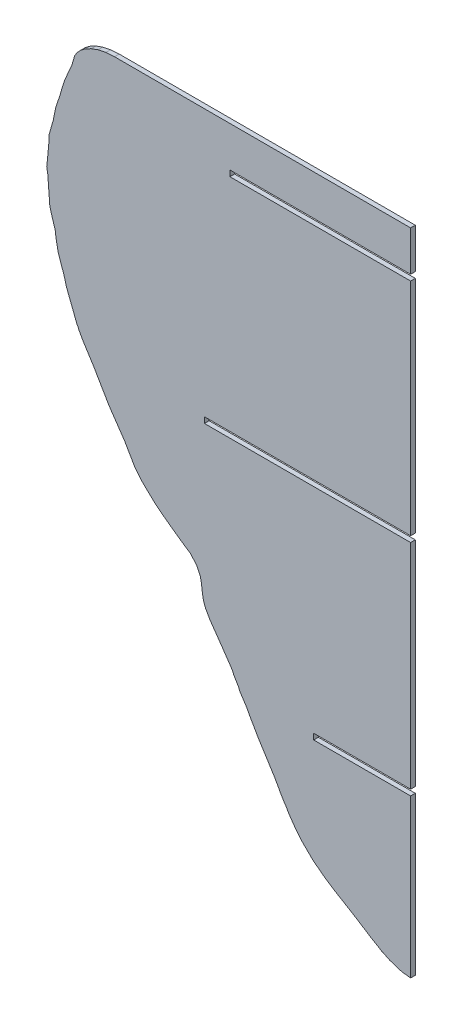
from build123d import *

# Parameters (mm, degrees)
EXTRUDE_1_DEPTH = 2


with BuildPart() as part:
    # Model → Extrude 1 (new body)
    with BuildSketch(Plane.XY):
        Polygon((-5553.9257, -52.95), (-5553.916, -52.9675), (-5553.9072, -52.9834), (-5553.8984, -52.9993), (-5553.8896, -53.0151), (-5553.2595, -53.948), (-5551.4807, -56.4991), (-5551.3896, -56.616), (-5551.2983, -56.7328), (-5548.9946, -59.7252), (-5548.3706, -60.4646), (-5548.355, -60.4803), (-5548.3496, -60.4855), (-5548.3105, -60.5317), (-5547.5281, -61.2947), (-5543.9182, -64.8505), (-5543.5627, -65.1965), (-5543.0049, -65.6568), (-5542.1001, -66.3395), (-5538.5322, -69.072), (-5538.2622, -69.2579), (-5537.9922, -69.4437), (-5537.4724, -69.7801), (-5534.2546, -71.9145), (-5530.1741, -74.3404), (-5524.4228, -77.8417), (-5519.5566, -80.987), (-5518.1645, -81.8527), (-5518.1201, -81.8767), (-5518.0757, -81.9007), (-5518.0315, -81.9247), (-5517.9871, -81.9487), (-5517.8228, -82.0496), (-5517.6584, -82.1503), (-5517.4985, -82.2342), (-5517.3386, -82.318), (-5517.2012, -82.3906), (-5517.0637, -82.4631), (-5516.0979, -83.0245), (-5514.0706, -84.3211), (-5513.8103, -84.4079), (-5513.55, -84.4948), (-5510.7139, -85.9042), (-5510.6553, -85.934), (-5510.5964, -85.9637), (-5510.3667, -86.035), (-5510.137, -86.1063), (-5509.2903, -86.3835), (-5505.6423, -87.5591), (-5504.637, -87.7399), (-5503.9382, -87.7903), (-5501.6404, -88.0699), (-5501.6404, -20.5677), (-5543.1523, -20.5677), (-5543.1523, -20.3177), (-5543.1523, -18.3177), (-5543.1523, -18.0677), (-5501.6404, -18.0677), (-5501.6404, 73.4017), (-5589.9341, 73.4017), (-5589.9341, 73.6517), (-5589.9341, 75.6517), (-5589.9341, 75.9017), (-5501.6404, 75.9017), (-5501.6404, 170.3516), (-5579.0183, 170.3516), (-5579.0183, 170.579), (-5579.0183, 172.579), (-5579.0183, 172.8516), (-5501.6404, 172.8516), (-5501.6404, 190.0592), (-5628.4258, 190.1311), (-5632.1106, 189.8824), (-5635.4304, 189.1919), (-5638.3535, 188.1436), (-5640.8486, 186.8212), (-5642.8845, 185.3084), (-5644.4297, 183.689), (-5645.4526, 182.0467), (-5646.511, 178.4865), (-5646.7537, 177.5711), (-5648.2297, 174.3211), (-5649.8113, 170.6813), (-5650.9299, 167.0724), (-5650.9321, 167.0647), (-5650.9343, 167.057), (-5650.9363, 167.0493), (-5650.9385, 167.0417), (-5651.0217, 166.7809), (-5651.8367, 163.9394), (-5652.7607, 161.2404), (-5653.0933, 160.2906), (-5653.6787, 158.3007), (-5653.7058, 158.149), (-5653.7332, 157.9972), (-5654.366, 154.8302), (-5654.5496, 153.9366), (-5654.7334, 153.0428), (-5654.9348, 152.4994), (-5654.9585, 152.4157), (-5654.9822, 152.332), (-5655.0166, 152.2376), (-5655.0513, 152.1432), (-5655.4878, 150.5501), (-5656.4294, 147.23), (-5656.4438, 146.9292), (-5656.4582, 146.6285), (-5656.458, 146.6267), (-5656.4578, 146.6249), (-5656.4622, 146.5386), (-5656.3625, 145.9525), (-5657.1309, 137.7478), (-5657.2251, 136.7743), (-5657.3196, 135.8007), (-5657.4492, 134.8204), (-5657.4482, 134.8146), (-5657.4478, 134.8117), (-5657.447, 134.8088), (-5657.4475, 134.805), (-5657.4482, 134.8011), (-5657.4492, 134.7934), (-5656.9805, 132.1648), (-5656.1113, 120.8204), (-5654.8765, 116.5286), (-5653.8384, 113.3779), (-5653.4121, 110.0677), (-5652.5168, 105.5138), (-5651.5073, 102.5451), (-5651.2888, 101.8879), (-5651.0701, 101.2308), (-5650.2598, 99.0715), (-5649.4951, 96.3724), (-5649.28, 95.5604), (-5649.0649, 94.7484), (-5649.0093, 94.604), (-5648.9534, 94.4595), (-5648.927, 94.3662), (-5648.9006, 94.273), (-5647.4136, 90.4251), (-5645.9595, 86.7167), (-5644.6628, 83.3692), (-5644.0706, 82.1503), (-5643.5137, 80.9746), (-5642.8044, 79.6431), (-5641.967, 78.1732), (-5641.9607, 78.163), (-5641.9543, 78.1528), (-5641.938, 78.1239), (-5641.9216, 78.095), (-5638.5063, 72.6757), (-5637.7131, 71.4158), (-5637.4958, 71.0792), (-5637.2786, 70.7426), (-5637.0884, 70.4131), (-5636.8979, 70.0836), (-5631.1887, 60.3224), (-5630.0537, 58.5599), (-5630.0508, 58.5556), (-5630.0452, 58.5468), (-5630.0393, 58.5381), (-5630.0281, 58.5206), (-5629.8733, 58.2958), (-5629.8215, 58.2208), (-5624.0552, 49.7976), (-5623.9019, 49.5236), (-5623.7485, 49.2495), (-5622.3557, 46.8379), (-5619.8931, 42.6358), (-5619.4536, 41.9365), (-5619.0059, 41.3799), (-5616.4141, 38.3178), (-5613.9075, 35.8834), (-5610.9761, 33.1492), (-5608.2405, 30.9581), (-5605.281, 28.7655), (-5605.0991, 28.6228), (-5604.917, 28.4958), (-5604.3252, 28.0574), (-5598.8289, 24.1556), (-5595.99, 22.2505), (-5595.4299, 21.6608), (-5593.353, 19.2774), (-5592.3154, 17.3077), (-5592.0061, 16.6149), (-5591.6968, 15.922), (-5591.2185, 13.5299), (-5590.7874, 10.1681), (-5590.3989, 7.8723), (-5590.1492, 6.9541), (-5589.3735, 4.9349), (-5589.0977, 4.4838), (-5588.8215, 4.0326), (-5587.6433, 1.9192), (-5582.5945, -5.3186), (-5582.0525, -6.0787), (-5582.0044, -6.1642), (-5581.9563, -6.2495), (-5578.1316, -11.8418), (-5577.7512, -12.6802), (-5577.324, -13.5854), (-5575.3962, -16.8573), (-5575.032, -17.6658), (-5574.6677, -18.4741), (-5572.5835, -21.6929), (-5571.9055, -22.7104), (-5570.2615, -25.7633), (-5566.7637, -31.8572), (-5562.6536, -38.3485), (-5559.9673, -42.6245), (-5558.5049, -45.2013), (-5556.9773, -47.9975), (-5555.9053, -49.7475), (-5555.8994, -49.756), (-5555.8936, -49.7644), (-5555.8879, -49.7728), (-5555.8821, -49.7812), (-5555.8745, -49.7936), (-5555.8669, -49.806), (-5555.8596, -49.8183), (-5555.852, -49.8307), (-5555.4004, -50.4873), (-5554.9487, -51.1439), (-5554.675, -51.6147), (-5554.4011, -52.0855), (-5554.1882, -52.4724), (-5553.9753, -52.8594), (-5553.9634, -52.8816), (-5553.9512, -52.9039), (-5553.939, -52.9261), align=None)
    extrude(amount=EXTRUDE_1_DEPTH)


solid = part.part
